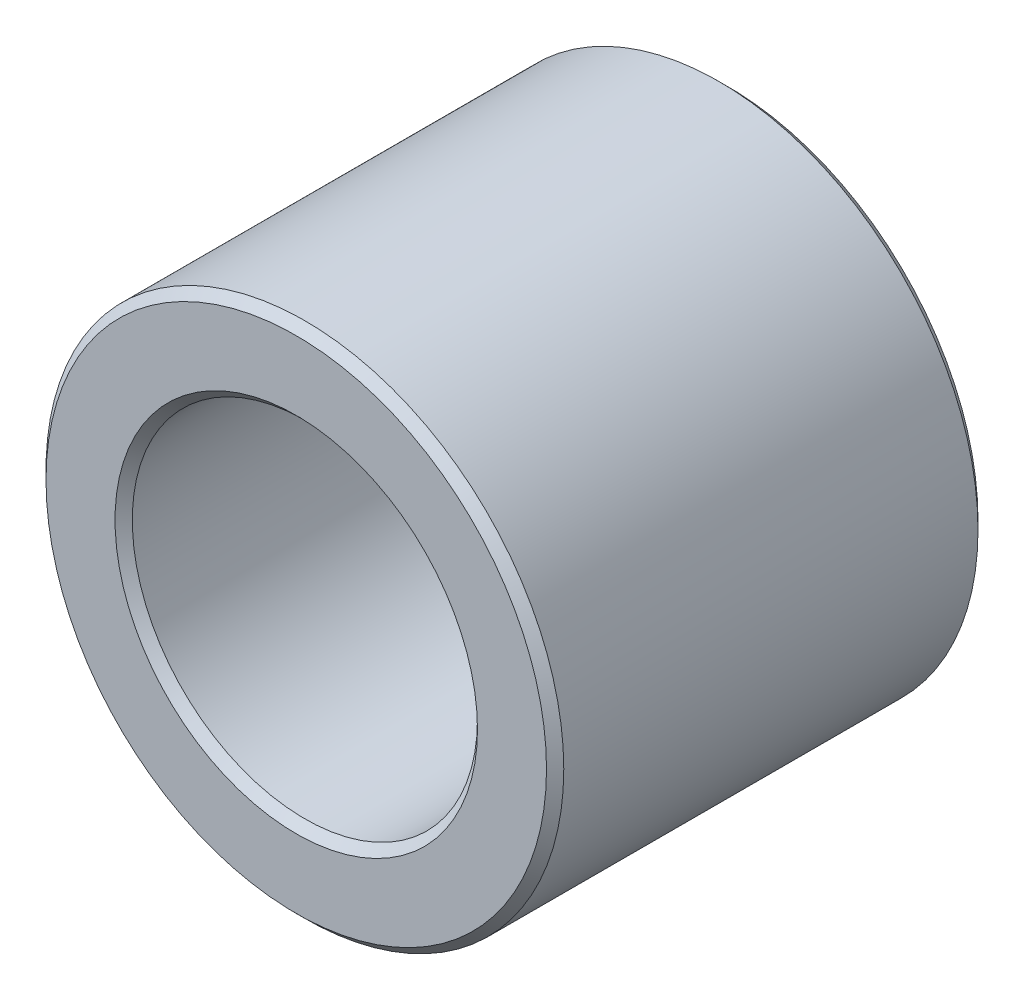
from build123d import *

# Parameters (mm, degrees)
ESQUISSE1_R        = 6
ESQUISSE1_R_2      = 4
BOSS_EXTRU_1_DEPTH = 10
CHANFREIN1_SIZE    = 0.2


with BuildPart() as part:
    # Esquisse1 → Boss.-Extru.1 (new body)
    with BuildSketch(Plane.XY):
        Circle(ESQUISSE1_R)
        Circle(ESQUISSE1_R_2, mode=Mode.SUBTRACT)
    extrude(amount=BOSS_EXTRU_1_DEPTH)

    # Chanfrein1
    chanfrein1_edges = [part.edges().sort_by_distance(p)[0] for p in [
        (-6, 0, 0),
        (-6, 0, 10),
        (-4, 0, 0),
        (-4, 0, 10),
    ]]
    chamfer(chanfrein1_edges, length=CHANFREIN1_SIZE)


solid = part.part
